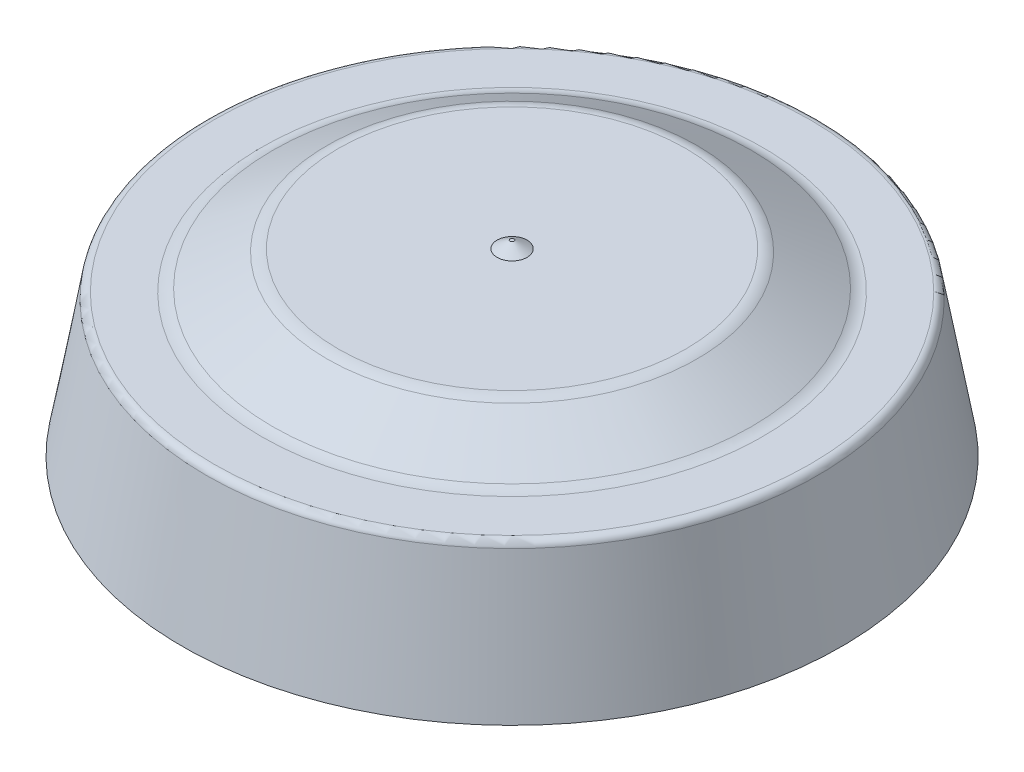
ISO-10303-21;
HEADER;
FILE_DESCRIPTION(('STEP AP214'),'2;1');
FILE_NAME('part.step','',(''),(''),'','','');
FILE_SCHEMA(('AUTOMOTIVE_DESIGN { 1 0 10303 214 1 1 1 1 }'));
ENDSEC;
DATA;
#1=APPLICATION_CONTEXT('core data for automotive mechanical design processes');
#2=APPLICATION_PROTOCOL_DEFINITION('international standard','automotive_design',2000,#1);
#3=PRODUCT_CONTEXT('',#1,'mechanical');
#4=PRODUCT('Part','Part','',(#3));
#5=PRODUCT_RELATED_PRODUCT_CATEGORY('part','',(#4));
#6=PRODUCT_DEFINITION_FORMATION('','',#4);
#7=PRODUCT_DEFINITION_CONTEXT('part definition',#1,'design');
#8=PRODUCT_DEFINITION('design','',#6,#7);
#9=PRODUCT_DEFINITION_SHAPE('','',#8);
#10=(LENGTH_UNIT() NAMED_UNIT(*) SI_UNIT(.MILLI.,.METRE.));
#11=(NAMED_UNIT(*) PLANE_ANGLE_UNIT() SI_UNIT($,.RADIAN.));
#12=(NAMED_UNIT(*) SI_UNIT($,.STERADIAN.) SOLID_ANGLE_UNIT());
#13=UNCERTAINTY_MEASURE_WITH_UNIT(LENGTH_MEASURE(1.E-05),#10,'distance_accuracy_value','');
#14=(GEOMETRIC_REPRESENTATION_CONTEXT(3) GLOBAL_UNCERTAINTY_ASSIGNED_CONTEXT((#13)) GLOBAL_UNIT_ASSIGNED_CONTEXT((#10,
#11,#12)) REPRESENTATION_CONTEXT('',''));
#15=CARTESIAN_POINT('',(0.,0.,0.));
#16=DIRECTION('',(0.,0.,1.));
#17=DIRECTION('',(1.,0.,0.));
#18=AXIS2_PLACEMENT_3D('',#15,#16,#17);
#19=CARTESIAN_POINT('',(0.,12.,0.));
#20=DIRECTION('',(0.,1.,0.));
#21=DIRECTION('',(0.,0.,1.));
#22=AXIS2_PLACEMENT_3D('',#19,#20,#21);
#23=PLANE('',#22);
#24=CARTESIAN_POINT('',(0.,12.,0.));
#25=DIRECTION('',(0.,1.,0.));
#26=DIRECTION('',(0.,0.,1.));
#27=AXIS2_PLACEMENT_3D('',#24,#25,#26);
#28=CIRCLE('',#27,1.);
#29=CARTESIAN_POINT('',(0.,12.,1.));
#30=VERTEX_POINT('',#29);
#31=EDGE_CURVE('E79',#30,#30,#28,.T.);
#32=ORIENTED_EDGE('',*,*,#31,.F.);
#33=EDGE_LOOP('',(#32));
#34=FACE_BOUND('',#33,.T.);
#35=CARTESIAN_POINT('',(0.,12.,0.));
#36=DIRECTION('',(0.,1.,0.));
#37=DIRECTION('',(0.,0.,1.));
#38=AXIS2_PLACEMENT_3D('',#35,#36,#37);
#39=CIRCLE('',#38,11.597655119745);
#40=CARTESIAN_POINT('',(0.,12.,11.597655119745));
#41=VERTEX_POINT('',#40);
#42=EDGE_CURVE('E47',#41,#41,#39,.T.);
#43=ORIENTED_EDGE('',*,*,#42,.T.);
#44=EDGE_LOOP('',(#43));
#45=FACE_BOUND('',#44,.T.);
#46=ADVANCED_FACE('F32',(#34,#45),#23,.T.);
#47=CARTESIAN_POINT('',(0.,9.5,0.));
#48=DIRECTION('',(0.,-1.,0.));
#49=DIRECTION('',(0.,0.,-1.));
#50=AXIS2_PLACEMENT_3D('',#47,#48,#49);
#51=CONICAL_SURFACE('',#50,16.3248936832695,1.04667374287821);
#52=CARTESIAN_POINT('',(0.,11.7986450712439,0.));
#53=DIRECTION('',(0.,1.,0.));
#54=DIRECTION('',(0.,0.,1.));
#55=AXIS2_PLACEMENT_3D('',#52,#53,#54);
#56=CIRCLE('',#55,12.3483354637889);
#57=CARTESIAN_POINT('',(0.,11.7986450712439,12.3483354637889));
#58=VERTEX_POINT('',#57);
#59=EDGE_CURVE('E52',#58,#58,#56,.F.);
#60=ORIENTED_EDGE('',*,*,#59,.T.);
#61=EDGE_LOOP('',(#60));
#62=FACE_BOUND('',#61,.T.);
#63=CARTESIAN_POINT('',(0.,9.70135492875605,0.));
#64=DIRECTION('',(0.,-1.,0.));
#65=DIRECTION('',(0.,0.,-1.));
#66=AXIS2_PLACEMENT_3D('',#63,#64,#65);
#67=CIRCLE('',#66,15.9765582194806);
#68=CARTESIAN_POINT('',(0.,9.70135492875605,-15.9765582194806));
#69=VERTEX_POINT('',#68);
#70=EDGE_CURVE('E55',#69,#69,#67,.F.);
#71=ORIENTED_EDGE('',*,*,#70,.T.);
#72=EDGE_LOOP('',(#71));
#73=FACE_BOUND('',#72,.T.);
#74=ADVANCED_FACE('F87',(#62,#73),#51,.T.);
#75=CARTESIAN_POINT('',(0.,9.5,-16.3248936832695));
#76=DIRECTION('',(0.,1.,0.));
#77=DIRECTION('',(0.,0.,1.));
#78=AXIS2_PLACEMENT_3D('',#75,#76,#77);
#79=PLANE('',#78);
#80=CARTESIAN_POINT('',(0.,9.5,0.));
#81=DIRECTION('',(0.,1.,0.));
#82=DIRECTION('',(0.,0.,1.));
#83=AXIS2_PLACEMENT_3D('',#80,#81,#82);
#84=CIRCLE('',#83,19.9053438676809);
#85=CARTESIAN_POINT('',(0.,9.5,19.9053438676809));
#86=VERTEX_POINT('',#85);
#87=EDGE_CURVE('E10',#86,#86,#84,.T.);
#88=ORIENTED_EDGE('',*,*,#87,.T.);
#89=EDGE_LOOP('',(#88));
#90=FACE_BOUND('',#89,.T.);
#91=CARTESIAN_POINT('',(0.,9.5,0.));
#92=DIRECTION('',(0.,1.,0.));
#93=DIRECTION('',(0.,0.,1.));
#94=AXIS2_PLACEMENT_3D('',#91,#92,#93);
#95=CIRCLE('',#94,16.7272385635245);
#96=CARTESIAN_POINT('',(0.,9.5,16.7272385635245));
#97=VERTEX_POINT('',#96);
#98=EDGE_CURVE('E43',#97,#97,#95,.F.);
#99=ORIENTED_EDGE('',*,*,#98,.T.);
#100=EDGE_LOOP('',(#99));
#101=FACE_BOUND('',#100,.T.);
#102=ADVANCED_FACE('F101',(#90,#101),#79,.T.);
#103=CARTESIAN_POINT('',(0.,0.,0.));
#104=DIRECTION('',(0.,-1.,0.));
#105=DIRECTION('',(0.,0.,-1.));
#106=AXIS2_PLACEMENT_3D('',#103,#104,#105);
#107=CONICAL_SURFACE('',#106,22.,0.174532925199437);
#108=CARTESIAN_POINT('',(0.,9.08682408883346,0.));
#109=DIRECTION('',(0.,1.,0.));
#110=DIRECTION('',(0.,0.,1.));
#111=AXIS2_PLACEMENT_3D('',#108,#109,#110);
#112=CIRCLE('',#111,20.397747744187);
#113=CARTESIAN_POINT('',(0.,9.08682408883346,20.397747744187));
#114=VERTEX_POINT('',#113);
#115=EDGE_CURVE('E39',#114,#114,#112,.F.);
#116=ORIENTED_EDGE('',*,*,#115,.T.);
#117=EDGE_LOOP('',(#116));
#118=FACE_BOUND('',#117,.T.);
#119=CARTESIAN_POINT('',(0.,0.,0.));
#120=DIRECTION('',(0.,-1.,0.));
#121=DIRECTION('',(0.,0.,-1.));
#122=AXIS2_PLACEMENT_3D('',#119,#120,#121);
#123=CIRCLE('',#122,22.);
#124=CARTESIAN_POINT('',(0.,0.,-22.));
#125=VERTEX_POINT('',#124);
#126=EDGE_CURVE('E58',#125,#125,#123,.T.);
#127=ORIENTED_EDGE('',*,*,#126,.F.);
#128=EDGE_LOOP('',(#127));
#129=FACE_BOUND('',#128,.T.);
#130=ADVANCED_FACE('F111',(#118,#129),#107,.T.);
#131=CARTESIAN_POINT('',(0.,0.,-22.));
#132=DIRECTION('',(0.,-1.,0.));
#133=DIRECTION('',(0.,0.,-1.));
#134=AXIS2_PLACEMENT_3D('',#131,#132,#133);
#135=PLANE('',#134);
#136=CARTESIAN_POINT('',(0.,0.,0.));
#137=DIRECTION('',(0.,-1.,0.));
#138=DIRECTION('',(0.,0.,-1.));
#139=AXIS2_PLACEMENT_3D('',#136,#137,#138);
#140=CIRCLE('',#139,19.9691467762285);
#141=CARTESIAN_POINT('',(0.,0.,-19.9691467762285));
#142=VERTEX_POINT('',#141);
#143=EDGE_CURVE('E62',#142,#142,#140,.T.);
#144=ORIENTED_EDGE('',*,*,#143,.F.);
#145=EDGE_LOOP('',(#144));
#146=FACE_BOUND('',#145,.T.);
#147=ORIENTED_EDGE('',*,*,#126,.T.);
#148=EDGE_LOOP('',(#147));
#149=FACE_BOUND('',#148,.T.);
#150=ADVANCED_FACE('F95',(#146,#149),#135,.T.);
#151=CARTESIAN_POINT('',(0.,10.5,0.));
#152=DIRECTION('',(0.,1.,0.));
#153=DIRECTION('',(0.,0.,1.));
#154=AXIS2_PLACEMENT_3D('',#151,#152,#153);
#155=TOROIDAL_SURFACE('',#154,11.597655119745,1.5);
#156=ORIENTED_EDGE('',*,*,#42,.F.);
#157=EDGE_LOOP('',(#156));
#158=FACE_BOUND('',#157,.T.);
#159=ORIENTED_EDGE('',*,*,#59,.F.);
#160=EDGE_LOOP('',(#159));
#161=FACE_BOUND('',#160,.T.);
#162=ADVANCED_FACE('F91',(#158,#161),#155,.T.);
#163=CARTESIAN_POINT('',(0.,11.,0.));
#164=DIRECTION('',(0.,1.,0.));
#165=DIRECTION('',(0.,0.,1.));
#166=AXIS2_PLACEMENT_3D('',#163,#164,#165);
#167=TOROIDAL_SURFACE('',#166,16.7272385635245,1.5);
#168=ORIENTED_EDGE('',*,*,#70,.F.);
#169=EDGE_LOOP('',(#168));
#170=FACE_BOUND('',#169,.T.);
#171=ORIENTED_EDGE('',*,*,#98,.F.);
#172=EDGE_LOOP('',(#171));
#173=FACE_BOUND('',#172,.T.);
#174=ADVANCED_FACE('F94',(#170,#173),#167,.F.);
#175=CARTESIAN_POINT('',(0.,10.,0.));
#176=DIRECTION('',(0.,1.,0.));
#177=DIRECTION('',(0.,0.,1.));
#178=AXIS2_PLACEMENT_3D('',#175,#176,#177);
#179=PLANE('',#178);
#180=CARTESIAN_POINT('',(0.,10.,0.));
#181=DIRECTION('',(0.,1.,0.));
#182=DIRECTION('',(0.,0.,1.));
#183=AXIS2_PLACEMENT_3D('',#180,#181,#182);
#184=CIRCLE('',#183,11.4635401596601);
#185=CARTESIAN_POINT('',(0.,10.,11.4635401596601));
#186=VERTEX_POINT('',#185);
#187=EDGE_CURVE('E72',#186,#186,#184,.F.);
#188=ORIENTED_EDGE('',*,*,#187,.T.);
#189=EDGE_LOOP('',(#188));
#190=FACE_BOUND('',#189,.T.);
#191=ADVANCED_FACE('F107',(#190),#179,.F.);
#192=CARTESIAN_POINT('',(0.,7.7684732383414,0.));
#193=DIRECTION('',(0.,-1.,0.));
#194=DIRECTION('',(0.,0.,-1.));
#195=AXIS2_PLACEMENT_3D('',#192,#193,#194);
#196=CONICAL_SURFACE('',#195,15.3239865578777,1.04667374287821);
#197=ORIENTED_EDGE('',*,*,#187,.F.);
#198=EDGE_LOOP('',(#197));
#199=FACE_BOUND('',#198,.T.);
#200=CARTESIAN_POINT('',(0.,7.96982816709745,0.));
#201=DIRECTION('',(0.,-1.,0.));
#202=DIRECTION('',(0.,0.,-1.));
#203=AXIS2_PLACEMENT_3D('',#200,#201,#202);
#204=CIRCLE('',#203,14.9756510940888);
#205=CARTESIAN_POINT('',(0.,7.96982816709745,-14.9756510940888));
#206=VERTEX_POINT('',#205);
#207=EDGE_CURVE('E69',#206,#206,#204,.F.);
#208=ORIENTED_EDGE('',*,*,#207,.F.);
#209=EDGE_LOOP('',(#208));
#210=FACE_BOUND('',#209,.T.);
#211=ADVANCED_FACE('F132',(#199,#210),#196,.F.);
#212=CARTESIAN_POINT('',(0.,7.5,-16.3248936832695));
#213=DIRECTION('',(0.,1.,0.));
#214=DIRECTION('',(0.,0.,1.));
#215=AXIS2_PLACEMENT_3D('',#212,#213,#214);
#216=PLANE('',#215);
#217=CARTESIAN_POINT('',(0.,7.5,0.));
#218=DIRECTION('',(0.,1.,0.));
#219=DIRECTION('',(0.,0.,1.));
#220=AXIS2_PLACEMENT_3D('',#217,#218,#219);
#221=CIRCLE('',#220,16.7272385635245);
#222=CARTESIAN_POINT('',(0.,7.5,16.7272385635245));
#223=VERTEX_POINT('',#222);
#224=EDGE_CURVE('E61',#223,#223,#221,.F.);
#225=ORIENTED_EDGE('',*,*,#224,.F.);
#226=EDGE_LOOP('',(#225));
#227=FACE_BOUND('',#226,.T.);
#228=CARTESIAN_POINT('',(0.,7.5,0.));
#229=DIRECTION('',(0.,1.,0.));
#230=DIRECTION('',(0.,0.,1.));
#231=AXIS2_PLACEMENT_3D('',#228,#229,#230);
#232=CIRCLE('',#231,18.646694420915);
#233=CARTESIAN_POINT('',(0.,7.5,18.646694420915));
#234=VERTEX_POINT('',#233);
#235=EDGE_CURVE('E65',#234,#234,#232,.F.);
#236=ORIENTED_EDGE('',*,*,#235,.T.);
#237=EDGE_LOOP('',(#236));
#238=FACE_BOUND('',#237,.T.);
#239=ADVANCED_FACE('F128',(#227,#238),#216,.F.);
#240=CARTESIAN_POINT('',(0.,-0.347296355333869,0.));
#241=DIRECTION('',(0.,-1.,0.));
#242=DIRECTION('',(0.,0.,-1.));
#243=AXIS2_PLACEMENT_3D('',#240,#241,#242);
#244=CONICAL_SURFACE('',#243,20.0303844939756,0.174532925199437);
#245=ORIENTED_EDGE('',*,*,#235,.F.);
#246=EDGE_LOOP('',(#245));
#247=FACE_BOUND('',#246,.T.);
#248=ORIENTED_EDGE('',*,*,#143,.T.);
#249=EDGE_LOOP('',(#248));
#250=FACE_BOUND('',#249,.T.);
#251=ADVANCED_FACE('F124',(#247,#250),#244,.F.);
#252=CARTESIAN_POINT('',(0.,11.,0.));
#253=DIRECTION('',(0.,1.,0.));
#254=DIRECTION('',(0.,0.,1.));
#255=AXIS2_PLACEMENT_3D('',#252,#253,#254);
#256=TOROIDAL_SURFACE('',#255,16.7272385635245,3.5);
#257=ORIENTED_EDGE('',*,*,#207,.T.);
#258=EDGE_LOOP('',(#257));
#259=FACE_BOUND('',#258,.T.);
#260=ORIENTED_EDGE('',*,*,#224,.T.);
#261=EDGE_LOOP('',(#260));
#262=FACE_BOUND('',#261,.T.);
#263=ADVANCED_FACE('F121',(#259,#262),#256,.T.);
#264=CARTESIAN_POINT('',(0.,9.,0.));
#265=DIRECTION('',(0.,1.,0.));
#266=DIRECTION('',(0.,0.,1.));
#267=AXIS2_PLACEMENT_3D('',#264,#265,#266);
#268=TOROIDAL_SURFACE('',#267,19.9053438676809,0.5);
#269=ORIENTED_EDGE('',*,*,#87,.F.);
#270=EDGE_LOOP('',(#269));
#271=FACE_BOUND('',#270,.T.);
#272=ORIENTED_EDGE('',*,*,#115,.F.);
#273=EDGE_LOOP('',(#272));
#274=FACE_BOUND('',#273,.T.);
#275=ADVANCED_FACE('F34',(#271,#274),#268,.T.);
#276=CARTESIAN_POINT('',(0.,12.,0.));
#277=DIRECTION('',(0.,-1.,0.));
#278=DIRECTION('',(0.,0.,1.));
#279=AXIS2_PLACEMENT_3D('',#276,#277,#278);
#280=CONICAL_SURFACE('',#279,1.,1.0471975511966);
#281=CARTESIAN_POINT('',(0.,12.5,0.));
#282=DIRECTION('',(0.,1.,0.));
#283=DIRECTION('',(0.,0.,1.));
#284=AXIS2_PLACEMENT_3D('',#281,#282,#283);
#285=CIRCLE('',#284,0.133974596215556);
#286=CARTESIAN_POINT('',(0.,12.5,0.133974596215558));
#287=VERTEX_POINT('',#286);
#288=EDGE_CURVE('E66',#287,#287,#285,.T.);
#289=CARTESIAN_POINT('',(0.,12.5,0.133974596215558));
#290=CARTESIAN_POINT('',(0.,12.4947916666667,0.142995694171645));
#291=CARTESIAN_POINT('',(0.,12.4895833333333,0.152016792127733));
#292=CARTESIAN_POINT('',(0.,12.4791666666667,0.170058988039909));
#293=CARTESIAN_POINT('',(0.,12.4739583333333,0.179080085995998));
#294=CARTESIAN_POINT('',(0.,12.4635416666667,0.197122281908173));
#295=CARTESIAN_POINT('',(0.,12.4583333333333,0.206143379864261));
#296=CARTESIAN_POINT('',(0.,12.4479166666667,0.224185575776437));
#297=CARTESIAN_POINT('',(0.,12.4427083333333,0.233206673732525));
#298=CARTESIAN_POINT('',(0.,12.4322916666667,0.251248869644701));
#299=CARTESIAN_POINT('',(0.,12.4270833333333,0.260269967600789));
#300=CARTESIAN_POINT('',(0.,12.4166666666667,0.278312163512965));
#301=CARTESIAN_POINT('',(0.,12.4114583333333,0.287333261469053));
#302=CARTESIAN_POINT('',(0.,12.4010416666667,0.305375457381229));
#303=CARTESIAN_POINT('',(0.,12.3958333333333,0.314396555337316));
#304=CARTESIAN_POINT('',(0.,12.3854166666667,0.332438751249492));
#305=CARTESIAN_POINT('',(0.,12.3802083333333,0.341459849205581));
#306=CARTESIAN_POINT('',(0.,12.3697916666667,0.359502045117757));
#307=CARTESIAN_POINT('',(0.,12.3645833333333,0.368523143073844));
#308=CARTESIAN_POINT('',(0.,12.3541666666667,0.38656533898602));
#309=CARTESIAN_POINT('',(0.,12.3489583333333,0.395586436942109));
#310=CARTESIAN_POINT('',(0.,12.3385416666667,0.413628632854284));
#311=CARTESIAN_POINT('',(0.,12.3333333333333,0.422649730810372));
#312=CARTESIAN_POINT('',(0.,12.3229166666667,0.440691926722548));
#313=CARTESIAN_POINT('',(0.,12.3177083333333,0.449713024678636));
#314=CARTESIAN_POINT('',(0.,12.3072916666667,0.467755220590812));
#315=CARTESIAN_POINT('',(0.,12.3020833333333,0.4767763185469));
#316=CARTESIAN_POINT('',(0.,12.2916666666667,0.494818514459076));
#317=CARTESIAN_POINT('',(0.,12.2864583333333,0.503839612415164));
#318=CARTESIAN_POINT('',(0.,12.2760416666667,0.52188180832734));
#319=CARTESIAN_POINT('',(0.,12.2708333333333,0.530902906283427));
#320=CARTESIAN_POINT('',(0.,12.2604166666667,0.548945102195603));
#321=CARTESIAN_POINT('',(0.,12.2552083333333,0.557966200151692));
#322=CARTESIAN_POINT('',(0.,12.2447916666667,0.576008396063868));
#323=CARTESIAN_POINT('',(0.,12.2395833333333,0.585029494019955));
#324=CARTESIAN_POINT('',(0.,12.2291666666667,0.603071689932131));
#325=CARTESIAN_POINT('',(0.,12.2239583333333,0.61209278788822));
#326=CARTESIAN_POINT('',(0.,12.2135416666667,0.630134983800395));
#327=CARTESIAN_POINT('',(0.,12.2083333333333,0.639156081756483));
#328=CARTESIAN_POINT('',(0.,12.1979166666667,0.657198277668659));
#329=CARTESIAN_POINT('',(0.,12.1927083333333,0.666219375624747));
#330=CARTESIAN_POINT('',(0.,12.1822916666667,0.684261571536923));
#331=CARTESIAN_POINT('',(0.,12.1770833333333,0.693282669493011));
#332=CARTESIAN_POINT('',(0.,12.1666666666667,0.711324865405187));
#333=CARTESIAN_POINT('',(0.,12.1614583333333,0.720345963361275));
#334=CARTESIAN_POINT('',(0.,12.1510416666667,0.738388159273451));
#335=CARTESIAN_POINT('',(0.,12.1458333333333,0.747409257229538));
#336=CARTESIAN_POINT('',(0.,12.1354166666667,0.765451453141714));
#337=CARTESIAN_POINT('',(0.,12.1302083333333,0.774472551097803));
#338=CARTESIAN_POINT('',(0.,12.1197916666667,0.792514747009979));
#339=CARTESIAN_POINT('',(0.,12.1145833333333,0.801535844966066));
#340=CARTESIAN_POINT('',(0.,12.1041666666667,0.819578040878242));
#341=CARTESIAN_POINT('',(0.,12.0989583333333,0.828599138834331));
#342=CARTESIAN_POINT('',(0.,12.0885416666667,0.846641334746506));
#343=CARTESIAN_POINT('',(0.,12.0833333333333,0.855662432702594));
#344=CARTESIAN_POINT('',(0.,12.0729166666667,0.87370462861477));
#345=CARTESIAN_POINT('',(0.,12.0677083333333,0.882725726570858));
#346=CARTESIAN_POINT('',(0.,12.0572916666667,0.900767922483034));
#347=CARTESIAN_POINT('',(0.,12.0520833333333,0.909789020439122));
#348=CARTESIAN_POINT('',(0.,12.0416666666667,0.927831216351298));
#349=CARTESIAN_POINT('',(0.,12.0364583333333,0.936852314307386));
#350=CARTESIAN_POINT('',(0.,12.0260416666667,0.954894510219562));
#351=CARTESIAN_POINT('',(0.,12.0208333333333,0.96391560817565));
#352=CARTESIAN_POINT('',(0.,12.0104166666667,0.981957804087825));
#353=CARTESIAN_POINT('',(0.,12.0052083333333,0.990978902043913));
#354=CARTESIAN_POINT('',(0.,12.,1.));
#355=B_SPLINE_CURVE_WITH_KNOTS('',3,(#289,#290,#291,#292,#293,#294,#295,#296,#297,#298,#299,
#300,#301,#302,#303,#304,#305,#306,#307,#308,#309,#310,#311,#312,#313,#314,#315,#316,#317,#318,
#319,#320,#321,#322,#323,#324,#325,#326,#327,#328,#329,#330,#331,#332,#333,#334,#335,#336,#337,
#338,#339,#340,#341,#342,#343,#344,#345,#346,#347,#348,#349,#350,#351,#352,#353,#354),
.UNSPECIFIED.,.F.,.F.,(4,2,2,2,2,2,2,2,2,2,2,2,2,2,2,2,2,2,2,2,2,2,2,2,2,2,2,2,2,2,2,2,4),(0.,
0.031250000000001,0.0625000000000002,0.0937500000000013,0.125000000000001,0.156250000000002,
0.187500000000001,0.218750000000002,0.250000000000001,0.281250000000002,0.312500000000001,
0.343750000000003,0.375000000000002,0.406250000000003,0.437500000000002,0.468750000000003,
0.500000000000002,0.531250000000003,0.562500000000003,0.593750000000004,0.625000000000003,
0.656250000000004,0.687500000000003,0.718750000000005,0.750000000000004,0.781250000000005,
0.812500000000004,0.843750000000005,0.875000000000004,0.906250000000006,0.937500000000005,
0.968750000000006,1.00000000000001),.UNSPECIFIED.);
#356=EDGE_CURVE('BSEAM83',#287,#30,#355,.T.);
#357=ORIENTED_EDGE('',*,*,#288,.F.);
#358=ORIENTED_EDGE('',*,*,#31,.T.);
#359=ORIENTED_EDGE('',*,*,#356,.T.);
#360=ORIENTED_EDGE('',*,*,#356,.F.);
#361=EDGE_LOOP('',(#357,#359,#358,#360));
#362=FACE_BOUND('',#361,.T.);
#363=ADVANCED_FACE('F83',(#362),#280,.T.);
#364=CARTESIAN_POINT('',(0.,12.5,0.));
#365=DIRECTION('',(0.,1.,0.));
#366=DIRECTION('',(0.,0.,1.));
#367=AXIS2_PLACEMENT_3D('',#364,#365,#366);
#368=PLANE('',#367);
#369=ORIENTED_EDGE('',*,*,#288,.T.);
#370=EDGE_LOOP('',(#369));
#371=FACE_BOUND('',#370,.T.);
#372=ADVANCED_FACE('F142',(#371),#368,.T.);
#373=CLOSED_SHELL('',(#46,#74,#102,#130,#150,#162,#174,#191,#211,#239,#251,#263,#275,#363,#372));
#374=MANIFOLD_SOLID_BREP('B2',#373);
#375=ADVANCED_BREP_SHAPE_REPRESENTATION('',(#18,#374),#14);
#376=SHAPE_DEFINITION_REPRESENTATION(#9,#375);
ENDSEC;
END-ISO-10303-21;
